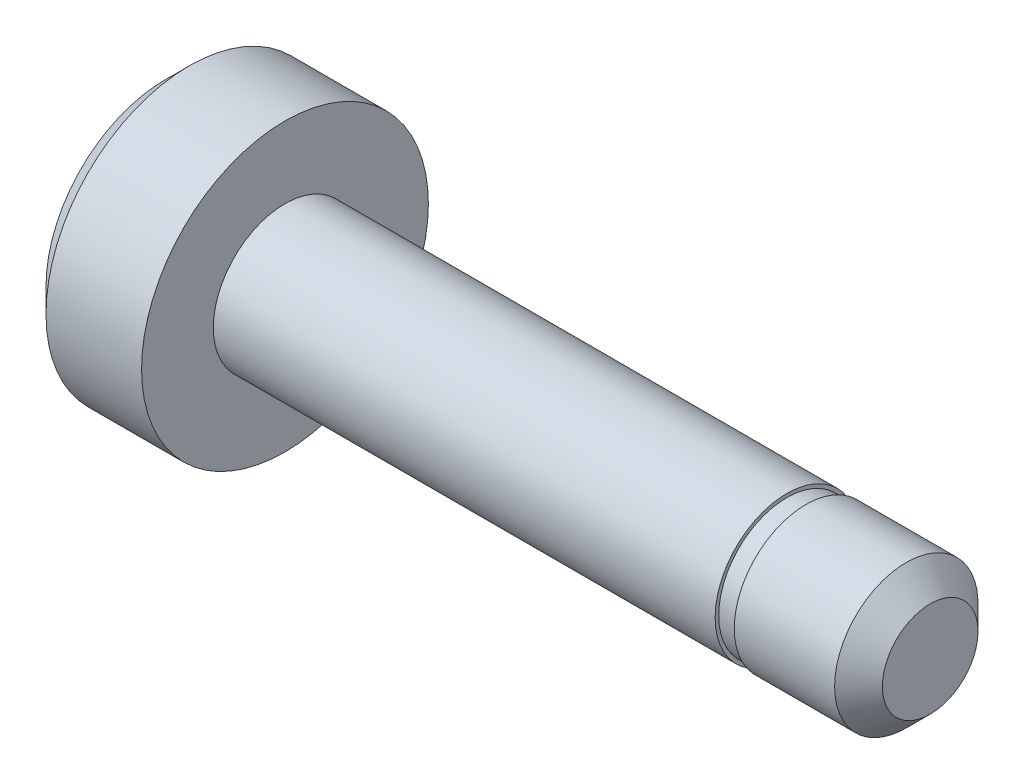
from build123d import *


with BuildPart() as part:
    # Esquisse1 → R_volution1 (revolve)
    with BuildSketch(Plane.XY, mode=Mode.PRIVATE) as r_volution1_sk:
        Polygon((0, 3), (0, 6), (-4, 6), (-5, 5), (-5, 0), (27, 0), (27, 2), (26, 3), (21.8, 3), (21.8, 2.85), (21, 2.85), (21, 3), align=None)
    revolve(r_volution1_sk.sketch.rotate(Axis((-27.093889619, 0, 0), (1, 0, 0)), 90), axis=Axis((-27.093889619, 0, 0), (1, 0, 0)))


solid = part.part
